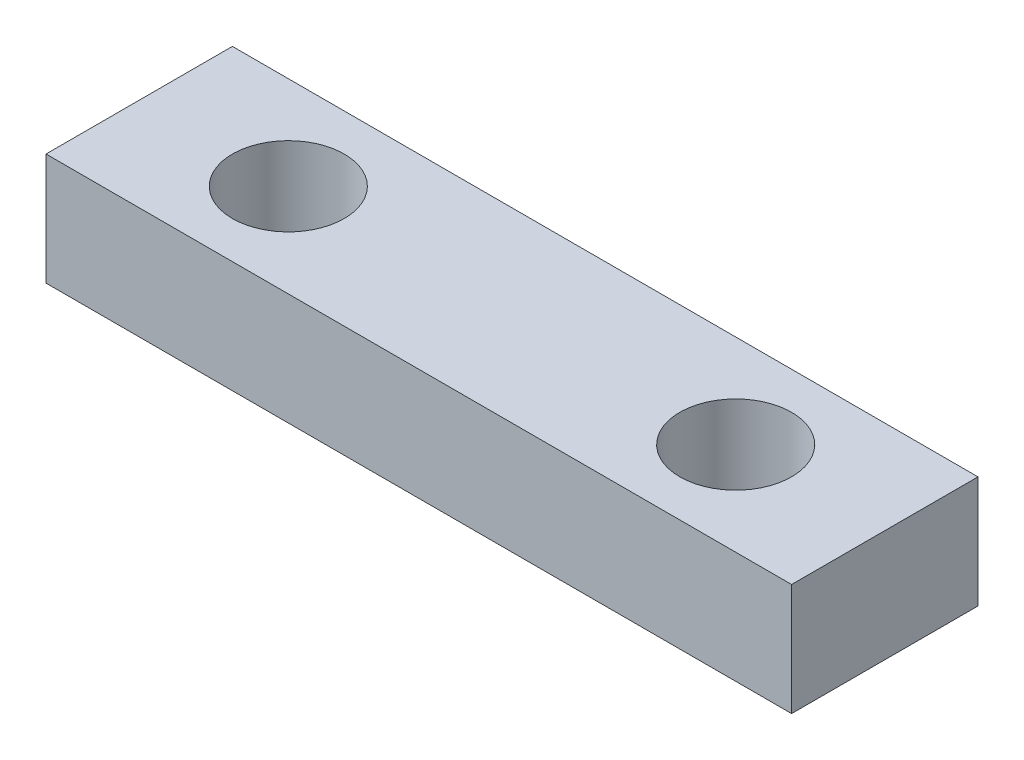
from build123d import *

# Parameters (mm, degrees)
SKETCH_1_W          = 20
SKETCH_1_H          = 5
EXTRUDE_1_DEPTH     = 3
SKETCH_2_R          = 1.5
CUT_EXTRUDE_1_DEPTH = 3


with BuildPart() as part:
    # Sketch 1 → Extrude 1 (new body)
    with BuildSketch(Plane(origin=(0, 0, 0), x_dir=(1, 0, 0), z_dir=(0, 1, 0))):
        Rectangle(SKETCH_1_W, SKETCH_1_H)
    extrude(amount=EXTRUDE_1_DEPTH)

    # Sketch 2 → Cut-Extrude 1 (cut)
    with BuildSketch(Plane(origin=(0, 3, 0), x_dir=(1, 0, 0), z_dir=(0, 1, 0))):
        with Locations(Location((-6, 0, 0), (0, 0, 270))):
            Circle(SKETCH_2_R)
        with Locations(Location((6, 0, 0), (0, 0, 270))):
            Circle(SKETCH_2_R)
    extrude(amount=-CUT_EXTRUDE_1_DEPTH, mode=Mode.SUBTRACT)


solid = part.part
